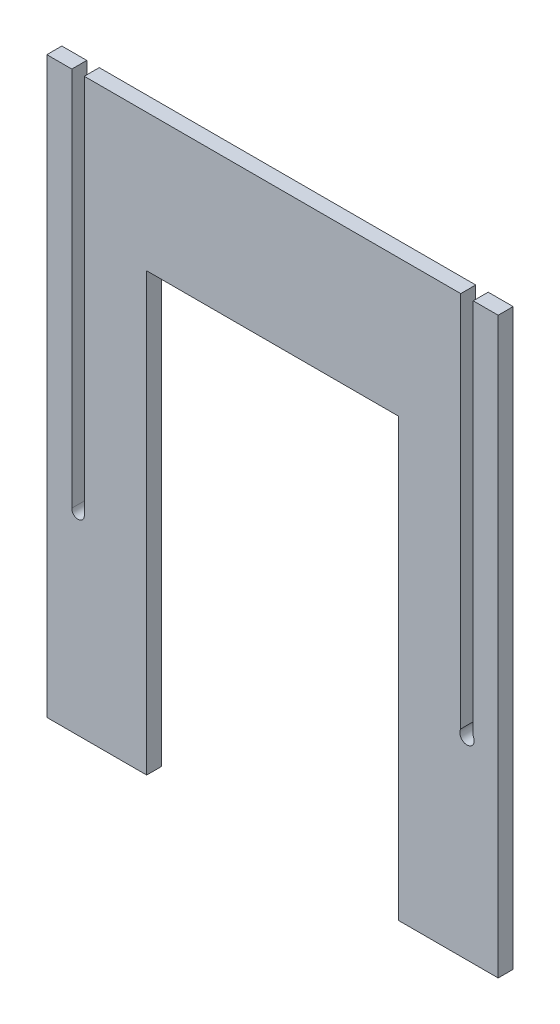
ISO-10303-21;
HEADER;
FILE_DESCRIPTION(('STEP AP214'),'2;1');
FILE_NAME('part.step','',(''),(''),'','','');
FILE_SCHEMA(('AUTOMOTIVE_DESIGN { 1 0 10303 214 1 1 1 1 }'));
ENDSEC;
DATA;
#1=APPLICATION_CONTEXT('core data for automotive mechanical design processes');
#2=APPLICATION_PROTOCOL_DEFINITION('international standard','automotive_design',2000,#1);
#3=PRODUCT_CONTEXT('',#1,'mechanical');
#4=PRODUCT('Part','Part','',(#3));
#5=PRODUCT_RELATED_PRODUCT_CATEGORY('part','',(#4));
#6=PRODUCT_DEFINITION_FORMATION('','',#4);
#7=PRODUCT_DEFINITION_CONTEXT('part definition',#1,'design');
#8=PRODUCT_DEFINITION('design','',#6,#7);
#9=PRODUCT_DEFINITION_SHAPE('','',#8);
#10=(LENGTH_UNIT() NAMED_UNIT(*) SI_UNIT(.MILLI.,.METRE.));
#11=(NAMED_UNIT(*) PLANE_ANGLE_UNIT() SI_UNIT($,.RADIAN.));
#12=(NAMED_UNIT(*) SI_UNIT($,.STERADIAN.) SOLID_ANGLE_UNIT());
#13=UNCERTAINTY_MEASURE_WITH_UNIT(LENGTH_MEASURE(1.E-05),#10,'distance_accuracy_value','');
#14=(GEOMETRIC_REPRESENTATION_CONTEXT(3) GLOBAL_UNCERTAINTY_ASSIGNED_CONTEXT((#13)) GLOBAL_UNIT_ASSIGNED_CONTEXT((#10,
#11,#12)) REPRESENTATION_CONTEXT('',''));
#15=CARTESIAN_POINT('',(0.,0.,0.));
#16=DIRECTION('',(0.,0.,1.));
#17=DIRECTION('',(1.,0.,0.));
#18=AXIS2_PLACEMENT_3D('',#15,#16,#17);
#19=CARTESIAN_POINT('',(260.491366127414,-278.824629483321,12.));
#20=DIRECTION('',(0.,0.,-1.));
#21=DIRECTION('',(-1.,0.,0.));
#22=AXIS2_PLACEMENT_3D('',#19,#20,#21);
#23=CYLINDRICAL_SURFACE('',#22,5.76490783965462);
#24=CARTESIAN_POINT('',(260.491366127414,-278.824629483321,0.));
#25=DIRECTION('',(0.,0.,1.));
#26=DIRECTION('',(1.,0.,0.));
#27=AXIS2_PLACEMENT_3D('',#24,#25,#26);
#28=CIRCLE('',#27,5.76490783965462);
#29=CARTESIAN_POINT('',(255.491366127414,-275.955106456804,0.));
#30=VERTEX_POINT('',#29);
#31=CARTESIAN_POINT('',(265.491366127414,-275.955106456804,0.));
#32=VERTEX_POINT('',#31);
#33=EDGE_CURVE('E176',#30,#32,#28,.T.);
#34=ORIENTED_EDGE('',*,*,#33,.F.);
#35=DIRECTION('',(0.,0.,-1.));
#36=VECTOR('',#35,1.);
#37=CARTESIAN_POINT('',(255.491366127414,-275.955106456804,12.));
#38=LINE('',#37,#36);
#39=CARTESIAN_POINT('',(255.491366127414,-275.955106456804,12.));
#40=VERTEX_POINT('',#39);
#41=EDGE_CURVE('E11',#40,#30,#38,.T.);
#42=ORIENTED_EDGE('',*,*,#41,.F.);
#43=CARTESIAN_POINT('',(260.491366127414,-278.824629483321,12.));
#44=DIRECTION('',(0.,0.,1.));
#45=DIRECTION('',(1.,0.,0.));
#46=AXIS2_PLACEMENT_3D('',#43,#44,#45);
#47=CIRCLE('',#46,5.76490783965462);
#48=CARTESIAN_POINT('',(265.491366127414,-275.955106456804,12.));
#49=VERTEX_POINT('',#48);
#50=EDGE_CURVE('E216',#40,#49,#47,.T.);
#51=ORIENTED_EDGE('',*,*,#50,.T.);
#52=DIRECTION('',(0.,0.,-1.));
#53=VECTOR('',#52,1.);
#54=CARTESIAN_POINT('',(265.491366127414,-275.955106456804,12.));
#55=LINE('',#54,#53);
#56=EDGE_CURVE('E109',#49,#32,#55,.T.);
#57=ORIENTED_EDGE('',*,*,#56,.T.);
#58=EDGE_LOOP('',(#34,#42,#51,#57));
#59=FACE_BOUND('',#58,.T.);
#60=ADVANCED_FACE('F35',(#59),#23,.F.);
#61=CARTESIAN_POINT('',(255.491366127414,0.,12.));
#62=DIRECTION('',(1.,0.,0.));
#63=DIRECTION('',(0.,0.,-1.));
#64=AXIS2_PLACEMENT_3D('',#61,#62,#63);
#65=PLANE('',#64);
#66=DIRECTION('',(0.,-1.,0.));
#67=VECTOR('',#66,1.);
#68=CARTESIAN_POINT('',(255.491366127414,0.,0.));
#69=LINE('',#68,#67);
#70=CARTESIAN_POINT('',(255.491366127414,26.1753705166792,0.));
#71=VERTEX_POINT('',#70);
#72=EDGE_CURVE('E179',#71,#30,#69,.T.);
#73=ORIENTED_EDGE('',*,*,#72,.F.);
#74=DIRECTION('',(0.,0.,-1.));
#75=VECTOR('',#74,1.);
#76=CARTESIAN_POINT('',(255.491366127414,26.1753705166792,12.));
#77=LINE('',#76,#75);
#78=CARTESIAN_POINT('',(255.491366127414,26.1753705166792,12.));
#79=VERTEX_POINT('',#78);
#80=EDGE_CURVE('E43',#79,#71,#77,.T.);
#81=ORIENTED_EDGE('',*,*,#80,.F.);
#82=DIRECTION('',(0.,-1.,0.));
#83=VECTOR('',#82,1.);
#84=CARTESIAN_POINT('',(255.491366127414,0.,12.));
#85=LINE('',#84,#83);
#86=EDGE_CURVE('E267',#79,#40,#85,.T.);
#87=ORIENTED_EDGE('',*,*,#86,.T.);
#88=ORIENTED_EDGE('',*,*,#41,.T.);
#89=EDGE_LOOP('',(#73,#81,#87,#88));
#90=FACE_BOUND('',#89,.T.);
#91=ADVANCED_FACE('F253',(#90),#65,.T.);
#92=CARTESIAN_POINT('',(0.,26.1753705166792,12.));
#93=DIRECTION('',(0.,1.,0.));
#94=DIRECTION('',(0.,0.,1.));
#95=AXIS2_PLACEMENT_3D('',#92,#93,#94);
#96=PLANE('',#95);
#97=DIRECTION('',(1.,0.,0.));
#98=VECTOR('',#97,1.);
#99=CARTESIAN_POINT('',(0.,26.1753705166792,0.));
#100=LINE('',#99,#98);
#101=CARTESIAN_POINT('',(-46.1866366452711,26.1753705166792,0.));
#102=VERTEX_POINT('',#101);
#103=EDGE_CURVE('E182',#102,#71,#100,.T.);
#104=ORIENTED_EDGE('',*,*,#103,.F.);
#105=DIRECTION('',(0.,0.,-1.));
#106=VECTOR('',#105,1.);
#107=CARTESIAN_POINT('',(-46.1866366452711,26.1753705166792,12.));
#108=LINE('',#107,#106);
#109=CARTESIAN_POINT('',(-46.1866366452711,26.1753705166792,12.));
#110=VERTEX_POINT('',#109);
#111=EDGE_CURVE('E242',#110,#102,#108,.T.);
#112=ORIENTED_EDGE('',*,*,#111,.F.);
#113=DIRECTION('',(1.,0.,0.));
#114=VECTOR('',#113,1.);
#115=CARTESIAN_POINT('',(0.,26.1753705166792,12.));
#116=LINE('',#115,#114);
#117=EDGE_CURVE('E249',#110,#79,#116,.T.);
#118=ORIENTED_EDGE('',*,*,#117,.T.);
#119=ORIENTED_EDGE('',*,*,#80,.T.);
#120=EDGE_LOOP('',(#104,#112,#118,#119));
#121=FACE_BOUND('',#120,.T.);
#122=ADVANCED_FACE('F247',(#121),#96,.T.);
#123=CARTESIAN_POINT('',(-46.1866366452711,0.,12.));
#124=DIRECTION('',(1.,0.,0.));
#125=DIRECTION('',(0.,0.,-1.));
#126=AXIS2_PLACEMENT_3D('',#123,#124,#125);
#127=PLANE('',#126);
#128=DIRECTION('',(0.,-1.,0.));
#129=VECTOR('',#128,1.);
#130=CARTESIAN_POINT('',(-46.1866366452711,0.,0.));
#131=LINE('',#130,#129);
#132=CARTESIAN_POINT('',(-46.1866366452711,-278.557330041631,0.));
#133=VERTEX_POINT('',#132);
#134=EDGE_CURVE('E185',#102,#133,#131,.T.);
#135=ORIENTED_EDGE('',*,*,#134,.T.);
#136=DIRECTION('',(0.,0.,-1.));
#137=VECTOR('',#136,1.);
#138=CARTESIAN_POINT('',(-46.1866366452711,-278.557330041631,12.));
#139=LINE('',#138,#137);
#140=CARTESIAN_POINT('',(-46.1866366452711,-278.557330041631,12.));
#141=VERTEX_POINT('',#140);
#142=EDGE_CURVE('E240',#141,#133,#139,.T.);
#143=ORIENTED_EDGE('',*,*,#142,.F.);
#144=DIRECTION('',(0.,-1.,0.));
#145=VECTOR('',#144,1.);
#146=CARTESIAN_POINT('',(-46.1866366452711,0.,12.));
#147=LINE('',#146,#145);
#148=EDGE_CURVE('E263',#110,#141,#147,.T.);
#149=ORIENTED_EDGE('',*,*,#148,.F.);
#150=ORIENTED_EDGE('',*,*,#111,.T.);
#151=EDGE_LOOP('',(#135,#143,#149,#150));
#152=FACE_BOUND('',#151,.T.);
#153=ADVANCED_FACE('F260',(#152),#127,.F.);
#154=CARTESIAN_POINT('',(-51.1866366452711,-278.824629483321,12.));
#155=DIRECTION('',(0.,0.,-1.));
#156=DIRECTION('',(-1.,0.,0.));
#157=AXIS2_PLACEMENT_3D('',#154,#155,#156);
#158=CYLINDRICAL_SURFACE('',#157,5.00713980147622);
#159=CARTESIAN_POINT('',(-51.1866366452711,-278.824629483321,0.));
#160=DIRECTION('',(0.,0.,1.));
#161=DIRECTION('',(1.,0.,0.));
#162=AXIS2_PLACEMENT_3D('',#159,#160,#161);
#163=CIRCLE('',#162,5.00713980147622);
#164=CARTESIAN_POINT('',(-56.1866366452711,-278.557330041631,0.));
#165=VERTEX_POINT('',#164);
#166=EDGE_CURVE('E188',#165,#133,#163,.T.);
#167=ORIENTED_EDGE('',*,*,#166,.F.);
#168=DIRECTION('',(0.,0.,-1.));
#169=VECTOR('',#168,1.);
#170=CARTESIAN_POINT('',(-56.1866366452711,-278.557330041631,12.));
#171=LINE('',#170,#169);
#172=CARTESIAN_POINT('',(-56.1866366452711,-278.557330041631,12.));
#173=VERTEX_POINT('',#172);
#174=EDGE_CURVE('E238',#173,#165,#171,.T.);
#175=ORIENTED_EDGE('',*,*,#174,.F.);
#176=CARTESIAN_POINT('',(-51.1866366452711,-278.824629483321,12.));
#177=DIRECTION('',(0.,0.,1.));
#178=DIRECTION('',(1.,0.,0.));
#179=AXIS2_PLACEMENT_3D('',#176,#177,#178);
#180=CIRCLE('',#179,5.00713980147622);
#181=EDGE_CURVE('E265',#173,#141,#180,.T.);
#182=ORIENTED_EDGE('',*,*,#181,.T.);
#183=ORIENTED_EDGE('',*,*,#142,.T.);
#184=EDGE_LOOP('',(#167,#175,#182,#183));
#185=FACE_BOUND('',#184,.T.);
#186=ADVANCED_FACE('F304',(#185),#158,.F.);
#187=CARTESIAN_POINT('',(-56.1866366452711,0.,12.));
#188=DIRECTION('',(1.,0.,0.));
#189=DIRECTION('',(0.,1.,0.));
#190=AXIS2_PLACEMENT_3D('',#187,#188,#189);
#191=PLANE('',#190);
#192=DIRECTION('',(0.,-1.,0.));
#193=VECTOR('',#192,1.);
#194=CARTESIAN_POINT('',(-56.1866366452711,0.,0.));
#195=LINE('',#194,#193);
#196=CARTESIAN_POINT('',(-56.1866366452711,26.1753705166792,0.));
#197=VERTEX_POINT('',#196);
#198=EDGE_CURVE('E191',#197,#165,#195,.T.);
#199=ORIENTED_EDGE('',*,*,#198,.F.);
#200=DIRECTION('',(0.,0.,-1.));
#201=VECTOR('',#200,1.);
#202=CARTESIAN_POINT('',(-56.1866366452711,26.1753705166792,12.));
#203=LINE('',#202,#201);
#204=CARTESIAN_POINT('',(-56.1866366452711,26.1753705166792,12.));
#205=VERTEX_POINT('',#204);
#206=EDGE_CURVE('E236',#205,#197,#203,.T.);
#207=ORIENTED_EDGE('',*,*,#206,.F.);
#208=DIRECTION('',(0.,-1.,0.));
#209=VECTOR('',#208,1.);
#210=CARTESIAN_POINT('',(-56.1866366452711,0.,12.));
#211=LINE('',#210,#209);
#212=EDGE_CURVE('E273',#205,#173,#211,.T.);
#213=ORIENTED_EDGE('',*,*,#212,.T.);
#214=ORIENTED_EDGE('',*,*,#174,.T.);
#215=EDGE_LOOP('',(#199,#207,#213,#214));
#216=FACE_BOUND('',#215,.T.);
#217=ADVANCED_FACE('F307',(#216),#191,.T.);
#218=CARTESIAN_POINT('',(0.,26.1753705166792,12.));
#219=DIRECTION('',(0.,-1.,0.));
#220=DIRECTION('',(1.,0.,0.));
#221=AXIS2_PLACEMENT_3D('',#218,#219,#220);
#222=PLANE('',#221);
#223=DIRECTION('',(-1.,0.,0.));
#224=VECTOR('',#223,1.);
#225=CARTESIAN_POINT('',(0.,26.1753705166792,0.));
#226=LINE('',#225,#224);
#227=CARTESIAN_POINT('',(-76.1866366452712,26.1753705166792,0.));
#228=VERTEX_POINT('',#227);
#229=EDGE_CURVE('E194',#197,#228,#226,.T.);
#230=ORIENTED_EDGE('',*,*,#229,.T.);
#231=DIRECTION('',(0.,0.,-1.));
#232=VECTOR('',#231,1.);
#233=CARTESIAN_POINT('',(-76.1866366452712,26.1753705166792,12.));
#234=LINE('',#233,#232);
#235=CARTESIAN_POINT('',(-76.1866366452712,26.1753705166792,12.));
#236=VERTEX_POINT('',#235);
#237=EDGE_CURVE('E233',#236,#228,#234,.T.);
#238=ORIENTED_EDGE('',*,*,#237,.F.);
#239=DIRECTION('',(-1.,0.,0.));
#240=VECTOR('',#239,1.);
#241=CARTESIAN_POINT('',(0.,26.1753705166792,12.));
#242=LINE('',#241,#240);
#243=EDGE_CURVE('E276',#205,#236,#242,.T.);
#244=ORIENTED_EDGE('',*,*,#243,.F.);
#245=ORIENTED_EDGE('',*,*,#206,.T.);
#246=EDGE_LOOP('',(#230,#238,#244,#245));
#247=FACE_BOUND('',#246,.T.);
#248=ADVANCED_FACE('F311',(#247),#222,.F.);
#249=CARTESIAN_POINT('',(-76.1866366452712,0.,12.));
#250=DIRECTION('',(1.,0.,0.));
#251=DIRECTION('',(0.,1.,0.));
#252=AXIS2_PLACEMENT_3D('',#249,#250,#251);
#253=PLANE('',#252);
#254=DIRECTION('',(0.,-1.,0.));
#255=VECTOR('',#254,1.);
#256=CARTESIAN_POINT('',(-76.1866366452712,0.,0.));
#257=LINE('',#256,#255);
#258=CARTESIAN_POINT('',(-76.1866366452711,-433.824629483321,0.));
#259=VERTEX_POINT('',#258);
#260=EDGE_CURVE('E196',#228,#259,#257,.T.);
#261=ORIENTED_EDGE('',*,*,#260,.T.);
#262=DIRECTION('',(0.,0.,-1.));
#263=VECTOR('',#262,1.);
#264=CARTESIAN_POINT('',(-76.1866366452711,-433.824629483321,12.));
#265=LINE('',#264,#263);
#266=CARTESIAN_POINT('',(-76.1866366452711,-433.824629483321,12.));
#267=VERTEX_POINT('',#266);
#268=EDGE_CURVE('E230',#267,#259,#265,.T.);
#269=ORIENTED_EDGE('',*,*,#268,.F.);
#270=DIRECTION('',(0.,-1.,0.));
#271=VECTOR('',#270,1.);
#272=CARTESIAN_POINT('',(-76.1866366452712,0.,12.));
#273=LINE('',#272,#271);
#274=EDGE_CURVE('E278',#236,#267,#273,.T.);
#275=ORIENTED_EDGE('',*,*,#274,.F.);
#276=ORIENTED_EDGE('',*,*,#237,.T.);
#277=EDGE_LOOP('',(#261,#269,#275,#276));
#278=FACE_BOUND('',#277,.T.);
#279=ADVANCED_FACE('F315',(#278),#253,.F.);
#280=CARTESIAN_POINT('',(0.,-433.824629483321,12.));
#281=DIRECTION('',(0.,1.,0.));
#282=DIRECTION('',(0.,0.,1.));
#283=AXIS2_PLACEMENT_3D('',#280,#281,#282);
#284=PLANE('',#283);
#285=DIRECTION('',(1.,0.,0.));
#286=VECTOR('',#285,1.);
#287=CARTESIAN_POINT('',(0.,-433.824629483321,0.));
#288=LINE('',#287,#286);
#289=CARTESIAN_POINT('',(3.81336335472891,-433.824629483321,0.));
#290=VERTEX_POINT('',#289);
#291=EDGE_CURVE('E198',#259,#290,#288,.T.);
#292=ORIENTED_EDGE('',*,*,#291,.T.);
#293=DIRECTION('',(0.,0.,-1.));
#294=VECTOR('',#293,1.);
#295=CARTESIAN_POINT('',(3.81336335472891,-433.824629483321,12.));
#296=LINE('',#295,#294);
#297=CARTESIAN_POINT('',(3.81336335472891,-433.824629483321,12.));
#298=VERTEX_POINT('',#297);
#299=EDGE_CURVE('E227',#298,#290,#296,.T.);
#300=ORIENTED_EDGE('',*,*,#299,.F.);
#301=DIRECTION('',(1.,0.,0.));
#302=VECTOR('',#301,1.);
#303=CARTESIAN_POINT('',(0.,-433.824629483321,12.));
#304=LINE('',#303,#302);
#305=EDGE_CURVE('E280',#267,#298,#304,.T.);
#306=ORIENTED_EDGE('',*,*,#305,.F.);
#307=ORIENTED_EDGE('',*,*,#268,.T.);
#308=EDGE_LOOP('',(#292,#300,#306,#307));
#309=FACE_BOUND('',#308,.T.);
#310=ADVANCED_FACE('F319',(#309),#284,.F.);
#311=CARTESIAN_POINT('',(3.81336335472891,0.,12.));
#312=DIRECTION('',(-1.,0.,0.));
#313=DIRECTION('',(0.,0.,1.));
#314=AXIS2_PLACEMENT_3D('',#311,#312,#313);
#315=PLANE('',#314);
#316=DIRECTION('',(0.,1.,0.));
#317=VECTOR('',#316,1.);
#318=CARTESIAN_POINT('',(3.81336335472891,0.,0.));
#319=LINE('',#318,#317);
#320=CARTESIAN_POINT('',(3.81336335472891,-83.8246294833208,0.));
#321=VERTEX_POINT('',#320);
#322=EDGE_CURVE('E200',#290,#321,#319,.T.);
#323=ORIENTED_EDGE('',*,*,#322,.T.);
#324=DIRECTION('',(0.,0.,-1.));
#325=VECTOR('',#324,1.);
#326=CARTESIAN_POINT('',(3.81336335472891,-83.8246294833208,12.));
#327=LINE('',#326,#325);
#328=CARTESIAN_POINT('',(3.81336335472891,-83.8246294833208,12.));
#329=VERTEX_POINT('',#328);
#330=EDGE_CURVE('E224',#329,#321,#327,.T.);
#331=ORIENTED_EDGE('',*,*,#330,.F.);
#332=DIRECTION('',(0.,1.,0.));
#333=VECTOR('',#332,1.);
#334=CARTESIAN_POINT('',(3.81336335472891,0.,12.));
#335=LINE('',#334,#333);
#336=EDGE_CURVE('E282',#298,#329,#335,.T.);
#337=ORIENTED_EDGE('',*,*,#336,.F.);
#338=ORIENTED_EDGE('',*,*,#299,.T.);
#339=EDGE_LOOP('',(#323,#331,#337,#338));
#340=FACE_BOUND('',#339,.T.);
#341=ADVANCED_FACE('F323',(#340),#315,.F.);
#342=CARTESIAN_POINT('',(0.,-83.8246294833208,12.));
#343=DIRECTION('',(0.,1.,0.));
#344=DIRECTION('',(0.,0.,1.));
#345=AXIS2_PLACEMENT_3D('',#342,#343,#344);
#346=PLANE('',#345);
#347=DIRECTION('',(1.,0.,0.));
#348=VECTOR('',#347,1.);
#349=CARTESIAN_POINT('',(0.,-83.8246294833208,0.));
#350=LINE('',#349,#348);
#351=CARTESIAN_POINT('',(205.491366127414,-83.8246294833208,0.));
#352=VERTEX_POINT('',#351);
#353=EDGE_CURVE('E202',#321,#352,#350,.T.);
#354=ORIENTED_EDGE('',*,*,#353,.T.);
#355=DIRECTION('',(0.,0.,-1.));
#356=VECTOR('',#355,1.);
#357=CARTESIAN_POINT('',(205.491366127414,-83.8246294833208,12.));
#358=LINE('',#357,#356);
#359=CARTESIAN_POINT('',(205.491366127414,-83.8246294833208,12.));
#360=VERTEX_POINT('',#359);
#361=EDGE_CURVE('E222',#360,#352,#358,.T.);
#362=ORIENTED_EDGE('',*,*,#361,.F.);
#363=DIRECTION('',(1.,0.,0.));
#364=VECTOR('',#363,1.);
#365=CARTESIAN_POINT('',(0.,-83.8246294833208,12.));
#366=LINE('',#365,#364);
#367=EDGE_CURVE('E284',#329,#360,#366,.T.);
#368=ORIENTED_EDGE('',*,*,#367,.F.);
#369=ORIENTED_EDGE('',*,*,#330,.T.);
#370=EDGE_LOOP('',(#354,#362,#368,#369));
#371=FACE_BOUND('',#370,.T.);
#372=ADVANCED_FACE('F327',(#371),#346,.F.);
#373=CARTESIAN_POINT('',(205.491366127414,0.,12.));
#374=DIRECTION('',(-1.,0.,0.));
#375=DIRECTION('',(0.,0.,1.));
#376=AXIS2_PLACEMENT_3D('',#373,#374,#375);
#377=PLANE('',#376);
#378=DIRECTION('',(0.,1.,0.));
#379=VECTOR('',#378,1.);
#380=CARTESIAN_POINT('',(205.491366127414,0.,0.));
#381=LINE('',#380,#379);
#382=CARTESIAN_POINT('',(205.491366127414,-433.824629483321,0.));
#383=VERTEX_POINT('',#382);
#384=EDGE_CURVE('E205',#383,#352,#381,.T.);
#385=ORIENTED_EDGE('',*,*,#384,.F.);
#386=DIRECTION('',(0.,0.,-1.));
#387=VECTOR('',#386,1.);
#388=CARTESIAN_POINT('',(205.491366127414,-433.824629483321,12.));
#389=LINE('',#388,#387);
#390=CARTESIAN_POINT('',(205.491366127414,-433.824629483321,12.));
#391=VERTEX_POINT('',#390);
#392=EDGE_CURVE('E220',#391,#383,#389,.T.);
#393=ORIENTED_EDGE('',*,*,#392,.F.);
#394=DIRECTION('',(0.,1.,0.));
#395=VECTOR('',#394,1.);
#396=CARTESIAN_POINT('',(205.491366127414,0.,12.));
#397=LINE('',#396,#395);
#398=EDGE_CURVE('E286',#391,#360,#397,.T.);
#399=ORIENTED_EDGE('',*,*,#398,.T.);
#400=ORIENTED_EDGE('',*,*,#361,.T.);
#401=EDGE_LOOP('',(#385,#393,#399,#400));
#402=FACE_BOUND('',#401,.T.);
#403=ADVANCED_FACE('F331',(#402),#377,.T.);
#404=CARTESIAN_POINT('',(0.,-433.824629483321,12.));
#405=DIRECTION('',(0.,-1.,0.));
#406=DIRECTION('',(0.,0.,-1.));
#407=AXIS2_PLACEMENT_3D('',#404,#405,#406);
#408=PLANE('',#407);
#409=DIRECTION('',(-1.,0.,0.));
#410=VECTOR('',#409,1.);
#411=CARTESIAN_POINT('',(0.,-433.824629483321,0.));
#412=LINE('',#411,#410);
#413=CARTESIAN_POINT('',(285.491366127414,-433.824629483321,0.));
#414=VERTEX_POINT('',#413);
#415=EDGE_CURVE('E208',#414,#383,#412,.T.);
#416=ORIENTED_EDGE('',*,*,#415,.F.);
#417=DIRECTION('',(0.,0.,-1.));
#418=VECTOR('',#417,1.);
#419=CARTESIAN_POINT('',(285.491366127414,-433.824629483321,12.));
#420=LINE('',#419,#418);
#421=CARTESIAN_POINT('',(285.491366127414,-433.824629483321,12.));
#422=VERTEX_POINT('',#421);
#423=EDGE_CURVE('E162',#422,#414,#420,.T.);
#424=ORIENTED_EDGE('',*,*,#423,.F.);
#425=DIRECTION('',(-1.,0.,0.));
#426=VECTOR('',#425,1.);
#427=CARTESIAN_POINT('',(0.,-433.824629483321,12.));
#428=LINE('',#427,#426);
#429=EDGE_CURVE('E169',#422,#391,#428,.T.);
#430=ORIENTED_EDGE('',*,*,#429,.T.);
#431=ORIENTED_EDGE('',*,*,#392,.T.);
#432=EDGE_LOOP('',(#416,#424,#430,#431));
#433=FACE_BOUND('',#432,.T.);
#434=ADVANCED_FACE('F290',(#433),#408,.T.);
#435=CARTESIAN_POINT('',(285.491366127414,0.,12.));
#436=DIRECTION('',(1.,0.,0.));
#437=DIRECTION('',(0.,1.,0.));
#438=AXIS2_PLACEMENT_3D('',#435,#436,#437);
#439=PLANE('',#438);
#440=DIRECTION('',(0.,-1.,0.));
#441=VECTOR('',#440,1.);
#442=CARTESIAN_POINT('',(285.491366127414,0.,0.));
#443=LINE('',#442,#441);
#444=CARTESIAN_POINT('',(285.491366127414,26.1753705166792,0.));
#445=VERTEX_POINT('',#444);
#446=EDGE_CURVE('E157',#445,#414,#443,.T.);
#447=ORIENTED_EDGE('',*,*,#446,.F.);
#448=DIRECTION('',(0.,0.,-1.));
#449=VECTOR('',#448,1.);
#450=CARTESIAN_POINT('',(285.491366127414,26.1753705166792,12.));
#451=LINE('',#450,#449);
#452=CARTESIAN_POINT('',(285.491366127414,26.1753705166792,12.));
#453=VERTEX_POINT('',#452);
#454=EDGE_CURVE('E152',#453,#445,#451,.T.);
#455=ORIENTED_EDGE('',*,*,#454,.F.);
#456=DIRECTION('',(0.,-1.,0.));
#457=VECTOR('',#456,1.);
#458=CARTESIAN_POINT('',(285.491366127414,0.,12.));
#459=LINE('',#458,#457);
#460=EDGE_CURVE('E155',#453,#422,#459,.T.);
#461=ORIENTED_EDGE('',*,*,#460,.T.);
#462=ORIENTED_EDGE('',*,*,#423,.T.);
#463=EDGE_LOOP('',(#447,#455,#461,#462));
#464=FACE_BOUND('',#463,.T.);
#465=ADVANCED_FACE('F154',(#464),#439,.T.);
#466=CARTESIAN_POINT('',(0.,26.1753705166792,12.));
#467=DIRECTION('',(0.,1.,0.));
#468=DIRECTION('',(-1.,0.,0.));
#469=AXIS2_PLACEMENT_3D('',#466,#467,#468);
#470=PLANE('',#469);
#471=DIRECTION('',(1.,0.,0.));
#472=VECTOR('',#471,1.);
#473=CARTESIAN_POINT('',(0.,26.1753705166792,0.));
#474=LINE('',#473,#472);
#475=CARTESIAN_POINT('',(265.491366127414,26.1753705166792,0.));
#476=VERTEX_POINT('',#475);
#477=EDGE_CURVE('E212',#476,#445,#474,.T.);
#478=ORIENTED_EDGE('',*,*,#477,.F.);
#479=DIRECTION('',(0.,0.,-1.));
#480=VECTOR('',#479,1.);
#481=CARTESIAN_POINT('',(265.491366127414,26.1753705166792,12.));
#482=LINE('',#481,#480);
#483=CARTESIAN_POINT('',(265.491366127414,26.1753705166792,12.));
#484=VERTEX_POINT('',#483);
#485=EDGE_CURVE('E102',#484,#476,#482,.T.);
#486=ORIENTED_EDGE('',*,*,#485,.F.);
#487=DIRECTION('',(1.,0.,0.));
#488=VECTOR('',#487,1.);
#489=CARTESIAN_POINT('',(0.,26.1753705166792,12.));
#490=LINE('',#489,#488);
#491=EDGE_CURVE('E166',#484,#453,#490,.T.);
#492=ORIENTED_EDGE('',*,*,#491,.T.);
#493=ORIENTED_EDGE('',*,*,#454,.T.);
#494=EDGE_LOOP('',(#478,#486,#492,#493));
#495=FACE_BOUND('',#494,.T.);
#496=ADVANCED_FACE('F171',(#495),#470,.T.);
#497=CARTESIAN_POINT('',(265.491366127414,0.,12.));
#498=DIRECTION('',(1.,0.,0.));
#499=DIRECTION('',(0.,1.,0.));
#500=AXIS2_PLACEMENT_3D('',#497,#498,#499);
#501=PLANE('',#500);
#502=DIRECTION('',(0.,-1.,0.));
#503=VECTOR('',#502,1.);
#504=CARTESIAN_POINT('',(265.491366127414,0.,0.));
#505=LINE('',#504,#503);
#506=EDGE_CURVE('E214',#476,#32,#505,.T.);
#507=ORIENTED_EDGE('',*,*,#506,.T.);
#508=ORIENTED_EDGE('',*,*,#56,.F.);
#509=DIRECTION('',(0.,-1.,0.));
#510=VECTOR('',#509,1.);
#511=CARTESIAN_POINT('',(265.491366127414,0.,12.));
#512=LINE('',#511,#510);
#513=EDGE_CURVE('E51',#484,#49,#512,.T.);
#514=ORIENTED_EDGE('',*,*,#513,.F.);
#515=ORIENTED_EDGE('',*,*,#485,.T.);
#516=EDGE_LOOP('',(#507,#508,#514,#515));
#517=FACE_BOUND('',#516,.T.);
#518=ADVANCED_FACE('F292',(#517),#501,.F.);
#519=CARTESIAN_POINT('',(0.,0.,12.));
#520=DIRECTION('',(0.,0.,1.));
#521=DIRECTION('',(1.,0.,0.));
#522=AXIS2_PLACEMENT_3D('',#519,#520,#521);
#523=PLANE('',#522);
#524=ORIENTED_EDGE('',*,*,#50,.F.);
#525=ORIENTED_EDGE('',*,*,#86,.F.);
#526=ORIENTED_EDGE('',*,*,#117,.F.);
#527=ORIENTED_EDGE('',*,*,#148,.T.);
#528=ORIENTED_EDGE('',*,*,#181,.F.);
#529=ORIENTED_EDGE('',*,*,#212,.F.);
#530=ORIENTED_EDGE('',*,*,#243,.T.);
#531=ORIENTED_EDGE('',*,*,#274,.T.);
#532=ORIENTED_EDGE('',*,*,#305,.T.);
#533=ORIENTED_EDGE('',*,*,#336,.T.);
#534=ORIENTED_EDGE('',*,*,#367,.T.);
#535=ORIENTED_EDGE('',*,*,#398,.F.);
#536=ORIENTED_EDGE('',*,*,#429,.F.);
#537=ORIENTED_EDGE('',*,*,#460,.F.);
#538=ORIENTED_EDGE('',*,*,#491,.F.);
#539=ORIENTED_EDGE('',*,*,#513,.T.);
#540=EDGE_LOOP('',(#524,#525,#526,#527,#528,#529,#530,#531,#532,#533,#534,#535,#536,#537,#538,#539));
#541=FACE_BOUND('',#540,.T.);
#542=ADVANCED_FACE('F165',(#541),#523,.T.);
#543=CARTESIAN_POINT('',(0.,0.,0.));
#544=DIRECTION('',(0.,0.,1.));
#545=DIRECTION('',(1.,0.,0.));
#546=AXIS2_PLACEMENT_3D('',#543,#544,#545);
#547=PLANE('',#546);
#548=ORIENTED_EDGE('',*,*,#33,.T.);
#549=ORIENTED_EDGE('',*,*,#506,.F.);
#550=ORIENTED_EDGE('',*,*,#477,.T.);
#551=ORIENTED_EDGE('',*,*,#446,.T.);
#552=ORIENTED_EDGE('',*,*,#415,.T.);
#553=ORIENTED_EDGE('',*,*,#384,.T.);
#554=ORIENTED_EDGE('',*,*,#353,.F.);
#555=ORIENTED_EDGE('',*,*,#322,.F.);
#556=ORIENTED_EDGE('',*,*,#291,.F.);
#557=ORIENTED_EDGE('',*,*,#260,.F.);
#558=ORIENTED_EDGE('',*,*,#229,.F.);
#559=ORIENTED_EDGE('',*,*,#198,.T.);
#560=ORIENTED_EDGE('',*,*,#166,.T.);
#561=ORIENTED_EDGE('',*,*,#134,.F.);
#562=ORIENTED_EDGE('',*,*,#103,.T.);
#563=ORIENTED_EDGE('',*,*,#72,.T.);
#564=EDGE_LOOP('',(#548,#549,#550,#551,#552,#553,#554,#555,#556,#557,#558,#559,#560,#561,#562,#563));
#565=FACE_BOUND('',#564,.T.);
#566=ADVANCED_FACE('F256',(#565),#547,.F.);
#567=CLOSED_SHELL('',(#60,#91,#122,#153,#186,#217,#248,#279,#310,#341,#372,#403,#434,#465,#496,
#518,#542,#566));
#568=MANIFOLD_SOLID_BREP('B2',#567);
#569=ADVANCED_BREP_SHAPE_REPRESENTATION('',(#18,#568),#14);
#570=SHAPE_DEFINITION_REPRESENTATION(#9,#569);
ENDSEC;
END-ISO-10303-21;
